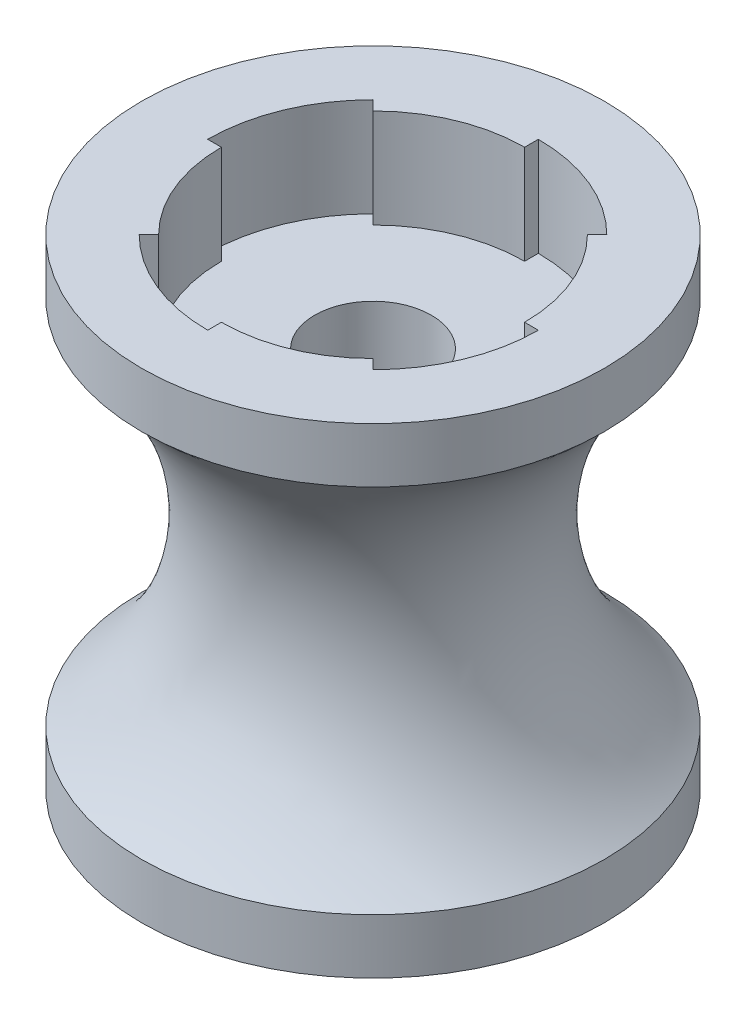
from build123d import *
from build123d.topology import SkipClean

# Parameters (mm, degrees)
ESQUISSE2_R                  = 4.25
ENL_V_MAT_EXTRU_1_DEPTH      = 87
ESQUISSE3_R                  = 11.05
ENL_V_MAT_EXTRU_2_DEPTH      = 7.2
ENL_V_MAT_EXTRU_3_DEPTH      = 7.2
R_P_TITION_CIRCULAIRE1_COUNT = 4


with BuildPart() as part:
    # Esquisse1 → R_volution1 (revolve)
    with BuildSketch(Plane(origin=(0, 0, 0), x_dir=(0, 0, -1), z_dir=(1, 0, 0)), mode=Mode.PRIVATE) as r_volution1_sk:
        with BuildLine():
            Line((0, 0), (-16.864471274, 0))
            Line((-16.864471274, 0), (-16.864471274, 4))
            ThreePointArc((-16.864471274, 4), (-12.170885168, 10.037485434), (-10.5, 17.5))
            Line((-10.5, 17.5), (0, 17.5))
            Line((0, 17.5), (0, 0))
        make_face()
    revolve(r_volution1_sk.sketch.rotate(Axis((0, 0, 0), (0, 1, 0)), 180), axis=Axis((0, 0, 0), (0, 1, 0)))

    # Esquisse2 → Enl_v. mat.-Extru.1 (cut)
    with BuildSketch(Plane.XZ):
        with Locations(Location((0, 0, 0), (0, 0, 270))):
            Circle(ESQUISSE2_R)
    extrude(amount=-ENL_V_MAT_EXTRU_1_DEPTH, mode=Mode.SUBTRACT)

    # Esquisse3 → Enl_v. mat.-Extru.2 (cut)
    with BuildSketch(Plane(origin=(0, 0, 0), x_dir=(-1, 0, 0), z_dir=(0, -1, 0))):
        with Locations(Location((0, 0, 0), (0, 0, 90))):
            Circle(ESQUISSE3_R)
    extrude(amount=-ENL_V_MAT_EXTRU_2_DEPTH, mode=Mode.SUBTRACT)

    # Esquisse4 → Enl_v. mat.-Extru.3 (cut)
    with BuildSketch(Plane.XZ):
        with BuildLine():
            ThreePointArc((0, 12.05), (-4.61133536, 11.132748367), (-8.520636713, 8.520636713))
            Line((-8.520636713, 8.520636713), (-7.813529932, 7.813529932))
            ThreePointArc((-7.813529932, 7.813529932), (-4.228651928, 10.208868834), (0, 11.05))
            Line((0, 11.05), (0, 12.05))
        make_face()
    enl_v_mat_extru_3 = extrude(amount=-ENL_V_MAT_EXTRU_3_DEPTH, mode=Mode.SUBTRACT)

    # R_p_tition circulaire1: Enl_v. mat.-Extru.3 ×4 about axis
    r_p_tition_circulaire1_axis = Axis((0, 16.71572008, 0), (0, -1, 0))
    for i in range(1, R_P_TITION_CIRCULAIRE1_COUNT):
        add(enl_v_mat_extru_3.rotate(r_p_tition_circulaire1_axis, i * 360 / R_P_TITION_CIRCULAIRE1_COUNT), mode=Mode.SUBTRACT)

    # Sym_trie1: part across plane


with BuildPart() as part_1:
    with SkipClean():  # the faces are left unmerged after this step: merging them gives an invalid solid
        add(part.part)
        add(part.part.mirror(Plane(origin=(0, 17.5, 0), x_dir=(0, 0, 1), z_dir=(0, -1, 0))))


solid = part_1.part
